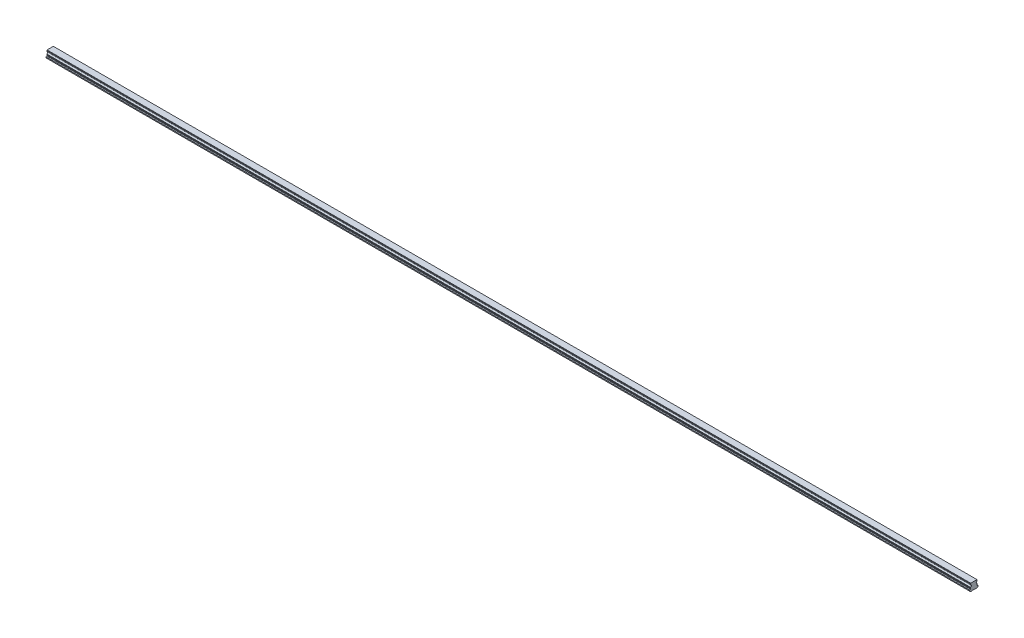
from build123d import *

# Parameters (mm, degrees)
BOSS_EXTRUDE1_DEPTH        = 2760
SKETCH3_R                  = 3
SKETCH3_R_2                = 2.5
CUT_EXTRUDE3_DEPTH         = 12
SKETCH3_2_R                = 2.5
CUT_EXTRUDE4_DEPTH         = 15
CHAMFER1_SIZE              = 0.5
LPATTERN4_COUNT            = 46
LPATTERN4_PITCH            = 60
CHAMFER1_OF_LPATTERN4_SIZE = 0.5


with BuildPart() as part:
    # Sketch1 → Boss-Extrude1 (new body)
    with BuildSketch(Plane(origin=(0, 0, 0), x_dir=(0, 0, -1), z_dir=(1, 0, 0))):
        with BuildLine():
            Line((9.375, 21.8), (-9.375, 21.8))
            Line((-9.375, 21.8), (-9.375, 20.756))
            Line((-9.375, 20.756), (-10, 19.415683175))
            Line((-10, 19.415683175), (-10, 17.685449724))
            ThreePointArc((-10, 17.685449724), (-7.2, 14.6), (-10, 11.514550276))
            Line((-10, 11.514550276), (-10, 9.784316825))
            Line((-10, 9.784316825), (-9.375, 8.444))
            Line((-9.375, 8.444), (-9.922688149, 6.4))
            Line((-9.922688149, 6.4), (-12.5, 5.489338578))
            Line((-12.5, 5.489338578), (-12.5, 2.65))
            Line((-12.5, 2.65), (-9.85, 0))
            Line((-9.85, 0), (-5.5, 0))
            Line((-5.5, 0), (-5, 0.5))
            Line((-5, 0.5), (5, 0.5))
            Line((5, 0.5), (5.5, 0))
            Line((5.5, 0), (9.85, 0))
            Line((9.85, 0), (12.5, 2.65))
            Line((12.5, 2.65), (12.5, 5.489338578))
            Line((12.5, 5.489338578), (9.922688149, 6.4))
            Line((9.922688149, 6.4), (9.375, 8.444))
            Line((9.375, 8.444), (10, 9.784316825))
            Line((10, 9.784316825), (10, 11.514550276))
            ThreePointArc((10, 11.514550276), (7.2, 14.6), (10, 17.685449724))
            Line((10, 17.685449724), (10, 19.415683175))
            Line((10, 19.415683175), (9.375, 20.756))
            Line((9.375, 20.756), (9.375, 21.8))
        make_face()
    extrude(amount=BOSS_EXTRUDE1_DEPTH)

    # Sketch3 → Cut-Extrude3 (cut)
    with BuildSketch(Plane.XZ):
        with Locations(Location((30, 0, 0), (0, 0, 270))):
            Circle(SKETCH3_R)
        with Locations(Location((30, 0, 0), (0, 0, 270))):
            Circle(SKETCH3_R_2, mode=Mode.SUBTRACT)
    cut_extrude3 = extrude(amount=-CUT_EXTRUDE3_DEPTH, mode=Mode.SUBTRACT)

    # Sketch3_2 → Cut-Extrude4 (cut)
    with BuildSketch(Plane.XZ):
        with Locations(Location((30, 0, 0), (0, 0, 270))):
            Circle(SKETCH3_2_R)
    cut_extrude4 = extrude(amount=-CUT_EXTRUDE4_DEPTH, mode=Mode.SUBTRACT)

    # Cut-Extrude5 cone 1 section (on through the dimple's axis) → Cut-Extrude5 (revolve, cut)
    with BuildSketch(Plane(origin=(30, 15, 0), x_dir=(0, 0, -1), z_dir=(1, 0, 0))):
        Polygon((0, 0), (2.5, 0), (0, 1.443375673), align=None)
    cut_extrude5 = revolve(axis=Axis((30, 15, 0), (0, 1, 0)), mode=Mode.SUBTRACT)

    # Chamfer1
    chamfer1_edges = [part.edges().sort_by_distance(p)[0] for p in [
        (30, 0.5, 3),
    ]]
    chamfer(chamfer1_edges, length=CHAMFER1_SIZE)

    # LPattern4: Cut-Extrude3, Cut-Extrude4, Cut-Extrude5 ×46
    with Locations(*[(i * LPATTERN4_PITCH, 0, 0) for i in range(1, LPATTERN4_COUNT)]):
        add(cut_extrude3, mode=Mode.SUBTRACT)
        add(cut_extrude4, mode=Mode.SUBTRACT)
        add(cut_extrude5, mode=Mode.SUBTRACT)

    # Chamfer1 of LPattern4
    chamfer1_of_lpattern4_edges = [part.edges().sort_by_distance(p)[0] for p in [
        (90, 0.5, 3),
        (150, 0.5, 3),
        (210, 0.5, 3),
        (270, 0.5, 3),
        (330, 0.5, 3),
        (390, 0.5, 3),
        (450, 0.5, 3),
        (510, 0.5, 3),
        (570, 0.5, 3),
        (630, 0.5, 3),
        (690, 0.5, 3),
        (750, 0.5, 3),
        (810, 0.5, 3),
        (870, 0.5, 3),
        (930, 0.5, 3),
        (990, 0.5, 3),
        (1050, 0.5, 3),
        (1110, 0.5, 3),
        (1170, 0.5, 3),
        (1230, 0.5, 3),
        (1290, 0.5, 3),
        (1350, 0.5, 3),
        (1410, 0.5, 3),
        (1470, 0.5, 3),
        (1530, 0.5, 3),
        (1590, 0.5, 3),
        (1650, 0.5, 3),
        (1710, 0.5, 3),
        (1770, 0.5, 3),
        (1830, 0.5, 3),
        (1890, 0.5, 3),
        (1950, 0.5, 3),
        (2010, 0.5, 3),
        (2070, 0.5, 3),
        (2130, 0.5, 3),
        (2190, 0.5, 3),
        (2250, 0.5, 3),
        (2310, 0.5, 3),
        (2370, 0.5, 3),
        (2430, 0.5, 3),
        (2490, 0.5, 3),
        (2550, 0.5, 3),
        (2610, 0.5, 3),
        (2670, 0.5, 3),
        (2730, 0.5, 3),
    ]]
    chamfer(chamfer1_of_lpattern4_edges, length=CHAMFER1_OF_LPATTERN4_SIZE)


solid = part.part
